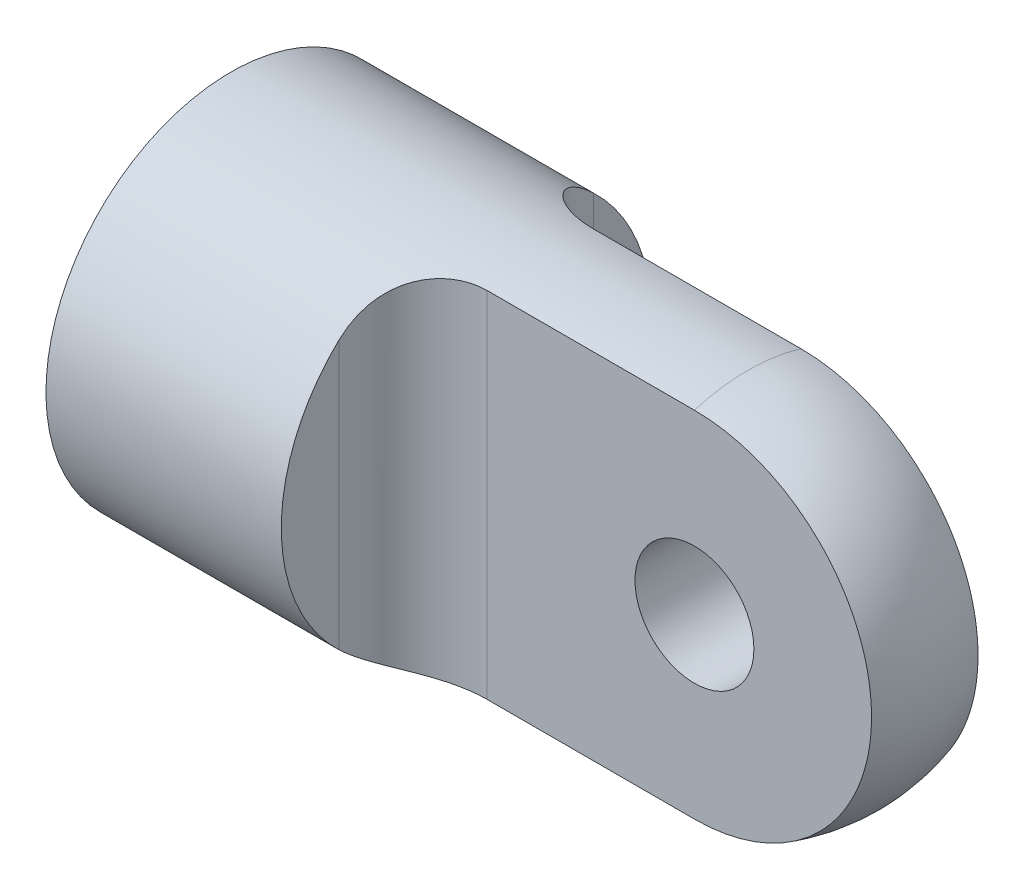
ISO-10303-21;
HEADER;
FILE_DESCRIPTION(('STEP AP214'),'2;1');
FILE_NAME('part.step','',(''),(''),'','','');
FILE_SCHEMA(('AUTOMOTIVE_DESIGN { 1 0 10303 214 1 1 1 1 }'));
ENDSEC;
DATA;
#1=APPLICATION_CONTEXT('core data for automotive mechanical design processes');
#2=APPLICATION_PROTOCOL_DEFINITION('international standard','automotive_design',2000,#1);
#3=PRODUCT_CONTEXT('',#1,'mechanical');
#4=PRODUCT('Part','Part','',(#3));
#5=PRODUCT_RELATED_PRODUCT_CATEGORY('part','',(#4));
#6=PRODUCT_DEFINITION_FORMATION('','',#4);
#7=PRODUCT_DEFINITION_CONTEXT('part definition',#1,'design');
#8=PRODUCT_DEFINITION('design','',#6,#7);
#9=PRODUCT_DEFINITION_SHAPE('','',#8);
#10=(LENGTH_UNIT() NAMED_UNIT(*) SI_UNIT(.MILLI.,.METRE.));
#11=(NAMED_UNIT(*) PLANE_ANGLE_UNIT() SI_UNIT($,.RADIAN.));
#12=(NAMED_UNIT(*) SI_UNIT($,.STERADIAN.) SOLID_ANGLE_UNIT());
#13=UNCERTAINTY_MEASURE_WITH_UNIT(LENGTH_MEASURE(1.E-05),#10,'distance_accuracy_value','');
#14=(GEOMETRIC_REPRESENTATION_CONTEXT(3) GLOBAL_UNCERTAINTY_ASSIGNED_CONTEXT((#13)) GLOBAL_UNIT_ASSIGNED_CONTEXT((#10,
#11,#12)) REPRESENTATION_CONTEXT('',''));
#15=CARTESIAN_POINT('',(0.,0.,0.));
#16=DIRECTION('',(0.,0.,1.));
#17=DIRECTION('',(1.,0.,0.));
#18=AXIS2_PLACEMENT_3D('',#15,#16,#17);
#19=CARTESIAN_POINT('',(-15.0622,0.,0.));
#20=DIRECTION('',(1.,0.,0.));
#21=DIRECTION('',(0.,1.,0.));
#22=AXIS2_PLACEMENT_3D('',#19,#20,#21);
#23=PLANE('',#22);
#24=CARTESIAN_POINT('',(-15.0622,0.,0.));
#25=DIRECTION('',(-1.,0.,0.));
#26=DIRECTION('',(0.,0.,1.));
#27=AXIS2_PLACEMENT_3D('',#24,#25,#26);
#28=CIRCLE('',#27,2.5527);
#29=CARTESIAN_POINT('',(-15.0622,0.,2.5527));
#30=VERTEX_POINT('',#29);
#31=EDGE_CURVE('E103',#30,#30,#28,.T.);
#32=ORIENTED_EDGE('',*,*,#31,.F.);
#33=EDGE_LOOP('',(#32));
#34=FACE_BOUND('',#33,.T.);
#35=CARTESIAN_POINT('',(-15.0622,0.,0.));
#36=DIRECTION('',(-1.,0.,0.));
#37=DIRECTION('',(0.,-1.,0.));
#38=AXIS2_PLACEMENT_3D('',#35,#36,#37);
#39=CIRCLE('',#38,7.9375);
#40=CARTESIAN_POINT('',(-15.0622,-7.9375,0.));
#41=VERTEX_POINT('',#40);
#42=EDGE_CURVE('E127',#41,#41,#39,.T.);
#43=ORIENTED_EDGE('',*,*,#42,.T.);
#44=EDGE_LOOP('',(#43));
#45=FACE_BOUND('',#44,.T.);
#46=ADVANCED_FACE('F38',(#34,#45),#23,.F.);
#47=CARTESIAN_POINT('',(7.1247,0.,0.));
#48=DIRECTION('',(-1.,0.,0.));
#49=DIRECTION('',(0.,-1.,0.));
#50=AXIS2_PLACEMENT_3D('',#47,#48,#49);
#51=SPHERICAL_SURFACE('',#50,7.9375);
#52=CARTESIAN_POINT('',(7.1247,0.,0.));
#53=DIRECTION('',(-1.,0.,0.));
#54=DIRECTION('',(0.,-1.,0.));
#55=AXIS2_PLACEMENT_3D('',#52,#53,#54);
#56=CIRCLE('',#55,7.9375);
#57=CARTESIAN_POINT('',(7.1247,-7.60119137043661,-2.286));
#58=VERTEX_POINT('',#57);
#59=CARTESIAN_POINT('',(7.12470000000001,-7.60119137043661,2.286));
#60=VERTEX_POINT('',#59);
#61=EDGE_CURVE('E130',#58,#60,#56,.T.);
#62=ORIENTED_EDGE('',*,*,#61,.F.);
#63=CARTESIAN_POINT('',(7.1247,0.,-2.286));
#64=DIRECTION('',(0.,0.,1.));
#65=DIRECTION('',(1.,0.,0.));
#66=AXIS2_PLACEMENT_3D('',#63,#64,#65);
#67=CIRCLE('',#66,7.60119137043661);
#68=CARTESIAN_POINT('',(7.1247,7.60119137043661,-2.286));
#69=VERTEX_POINT('',#68);
#70=EDGE_CURVE('E116',#58,#69,#67,.T.);
#71=ORIENTED_EDGE('',*,*,#70,.T.);
#72=CARTESIAN_POINT('',(7.1247,7.6011913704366,2.286));
#73=VERTEX_POINT('',#72);
#74=EDGE_CURVE('E131',#73,#69,#56,.T.);
#75=ORIENTED_EDGE('',*,*,#74,.F.);
#76=CARTESIAN_POINT('',(7.1247,0.,2.286));
#77=DIRECTION('',(0.,0.,-1.));
#78=DIRECTION('',(-1.,0.,0.));
#79=AXIS2_PLACEMENT_3D('',#76,#77,#78);
#80=CIRCLE('',#79,7.60119137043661);
#81=EDGE_CURVE('E59',#73,#60,#80,.T.);
#82=ORIENTED_EDGE('',*,*,#81,.T.);
#83=EDGE_LOOP('',(#62,#71,#75,#82));
#84=FACE_BOUND('',#83,.T.);
#85=ADVANCED_FACE('F168',(#84),#51,.T.);
#86=CARTESIAN_POINT('',(-15.0622,0.,0.));
#87=DIRECTION('',(-1.,0.,0.));
#88=DIRECTION('',(0.,-1.,0.));
#89=AXIS2_PLACEMENT_3D('',#86,#87,#88);
#90=CYLINDRICAL_SURFACE('',#89,7.9375);
#91=ORIENTED_EDGE('',*,*,#42,.F.);
#92=EDGE_LOOP('',(#91));
#93=FACE_BOUND('',#92,.T.);
#94=ORIENTED_EDGE('',*,*,#74,.T.);
#95=DIRECTION('',(-1.,0.,0.));
#96=VECTOR('',#95,1.);
#97=CARTESIAN_POINT('',(-15.0622,7.60119137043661,-2.286));
#98=LINE('',#97,#96);
#99=CARTESIAN_POINT('',(-1.78410862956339,7.60119137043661,-2.286));
#100=VERTEX_POINT('',#99);
#101=EDGE_CURVE('E11',#69,#100,#98,.T.);
#102=ORIENTED_EDGE('',*,*,#101,.T.);
#103=CARTESIAN_POINT('',(-1.78410862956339,-7.60119137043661,-2.286));
#104=CARTESIAN_POINT('',(-1.61365310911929,-7.60119066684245,-2.28600315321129));
#105=CARTESIAN_POINT('',(-1.44318540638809,-7.59709120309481,-2.29976913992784));
#106=CARTESIAN_POINT('',(-1.10707106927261,-7.58035076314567,-2.35435595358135));
#107=CARTESIAN_POINT('',(-0.941424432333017,-7.56770979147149,-2.39517676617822));
#108=CARTESIAN_POINT('',(-0.619618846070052,-7.53293356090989,-2.50239358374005));
#109=CARTESIAN_POINT('',(-0.463462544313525,-7.51079566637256,-2.56879668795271));
#110=CARTESIAN_POINT('',(-0.16517553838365,-7.45569235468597,-2.72458232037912));
#111=CARTESIAN_POINT('',(-0.023042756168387,-7.4227285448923,-2.81396143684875));
#112=CARTESIAN_POINT('',(0.242764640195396,-7.34476408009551,-3.01156747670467));
#113=CARTESIAN_POINT('',(0.366513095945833,-7.29981372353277,-3.11971499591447));
#114=CARTESIAN_POINT('',(0.593344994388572,-7.19683688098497,-3.3504276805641));
#115=CARTESIAN_POINT('',(0.696429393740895,-7.13881100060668,-3.47299217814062));
#116=CARTESIAN_POINT('',(0.881768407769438,-7.00841328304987,-3.7292070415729));
#117=CARTESIAN_POINT('',(0.96368822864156,-6.93583975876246,-3.86299585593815));
#118=CARTESIAN_POINT('',(1.10463365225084,-6.77742035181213,-4.13463642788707));
#119=CARTESIAN_POINT('',(1.16365312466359,-6.6915709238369,-4.27248926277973));
#120=CARTESIAN_POINT('',(1.26439881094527,-6.49966660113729,-4.55967280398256));
#121=CARTESIAN_POINT('',(1.30414468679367,-6.39249817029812,-4.70894534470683));
#122=CARTESIAN_POINT('',(1.3611257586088,-6.16572531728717,-5.0022156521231));
#123=CARTESIAN_POINT('',(1.37834653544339,-6.04611298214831,-5.14620998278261));
#124=CARTESIAN_POINT('',(1.39217210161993,-5.82258792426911,-5.39661073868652));
#125=CARTESIAN_POINT('',(1.39232918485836,-5.72060798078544,-5.50459032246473));
#126=CARTESIAN_POINT('',(1.38250216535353,-5.51098615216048,-5.71445233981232));
#127=CARTESIAN_POINT('',(1.3725132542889,-5.40334160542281,-5.81633185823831));
#128=CARTESIAN_POINT('',(1.32978369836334,-5.07268135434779,-6.11222109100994));
#129=CARTESIAN_POINT('',(1.28427296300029,-4.84220409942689,-6.29618548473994));
#130=CARTESIAN_POINT('',(1.18590077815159,-4.42808696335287,-6.59112990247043));
#131=CARTESIAN_POINT('',(1.13798896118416,-4.24776017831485,-6.7086774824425));
#132=CARTESIAN_POINT('',(1.03426595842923,-3.87976253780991,-6.92800097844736));
#133=CARTESIAN_POINT('',(0.978450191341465,-3.69208746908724,-7.02976767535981));
#134=CARTESIAN_POINT('',(0.862930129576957,-3.30971298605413,-7.21770283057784));
#135=CARTESIAN_POINT('',(0.803217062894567,-3.11499819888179,-7.30383432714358));
#136=CARTESIAN_POINT('',(0.684351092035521,-2.71918890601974,-7.46023983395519));
#137=CARTESIAN_POINT('',(0.625198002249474,-2.51809661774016,-7.53051928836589));
#138=CARTESIAN_POINT('',(0.526209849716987,-2.15954765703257,-7.63978103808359));
#139=CARTESIAN_POINT('',(0.485191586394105,-2.00346543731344,-7.68221292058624));
#140=CARTESIAN_POINT('',(0.408754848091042,-1.68767472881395,-7.75770642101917));
#141=CARTESIAN_POINT('',(0.373335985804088,-1.52796649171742,-7.79076868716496));
#142=CARTESIAN_POINT('',(0.310968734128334,-1.20617746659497,-7.84700874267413));
#143=CARTESIAN_POINT('',(0.283970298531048,-1.04411692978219,-7.87024523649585));
#144=CARTESIAN_POINT('',(0.24071382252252,-0.717441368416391,-7.90671699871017));
#145=CARTESIAN_POINT('',(0.224453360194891,-0.552826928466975,-7.91995452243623));
#146=CARTESIAN_POINT('',(0.204406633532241,-0.220487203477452,-7.93619927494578));
#147=CARTESIAN_POINT('',(0.20075911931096,-0.0527476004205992,-7.939092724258));
#148=CARTESIAN_POINT('',(0.206792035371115,0.282333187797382,-7.93424704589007));
#149=CARTESIAN_POINT('',(0.216473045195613,0.449674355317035,-7.92650745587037));
#150=CARTESIAN_POINT('',(0.248041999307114,0.783183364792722,-7.90054810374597));
#151=CARTESIAN_POINT('',(0.269990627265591,0.949341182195,-7.8822762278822));
#152=CARTESIAN_POINT('',(0.323760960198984,1.27859695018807,-7.83560902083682));
#153=CARTESIAN_POINT('',(0.355585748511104,1.44169392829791,-7.80721052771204));
#154=CARTESIAN_POINT('',(0.43867835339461,1.82068327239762,-7.72906456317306));
#155=CARTESIAN_POINT('',(0.492854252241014,2.03510856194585,-7.67532458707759));
#156=CARTESIAN_POINT('',(0.607655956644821,2.45719279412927,-7.55079946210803));
#157=CARTESIAN_POINT('',(0.668284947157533,2.66484832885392,-7.4800058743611));
#158=CARTESIAN_POINT('',(0.790509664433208,3.07334878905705,-7.32163994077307));
#159=CARTESIAN_POINT('',(0.852105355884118,3.27419396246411,-7.23406820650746));
#160=CARTESIAN_POINT('',(0.971495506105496,3.66879847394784,-7.04215261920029));
#161=CARTESIAN_POINT('',(1.02929200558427,3.86256159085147,-6.93781787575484));
#162=CARTESIAN_POINT('',(1.12072307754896,4.18621019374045,-6.74564558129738));
#163=CARTESIAN_POINT('',(1.15644763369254,4.31803657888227,-6.66205746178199));
#164=CARTESIAN_POINT('',(1.22217558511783,4.5775175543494,-6.48650678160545));
#165=CARTESIAN_POINT('',(1.25217883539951,4.70517203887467,-6.3945440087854));
#166=CARTESIAN_POINT('',(1.30468326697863,4.95552807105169,-6.20253892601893));
#167=CARTESIAN_POINT('',(1.3271975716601,5.07823794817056,-6.10251113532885));
#168=CARTESIAN_POINT('',(1.36291788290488,5.31820276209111,-5.89455707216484));
#169=CARTESIAN_POINT('',(1.37612706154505,5.4354595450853,-5.78663350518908));
#170=CARTESIAN_POINT('',(1.38916802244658,5.63279981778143,-5.59366124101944));
#171=CARTESIAN_POINT('',(1.39164927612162,5.71436988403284,-5.51030692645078));
#172=CARTESIAN_POINT('',(1.38973019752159,5.87371246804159,-5.34012958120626));
#173=CARTESIAN_POINT('',(1.38533163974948,5.9514859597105,-5.25330745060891));
#174=CARTESIAN_POINT('',(1.36880686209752,6.10273200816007,-5.07681617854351));
#175=CARTESIAN_POINT('',(1.35668745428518,6.17620829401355,-4.98714961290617));
#176=CARTESIAN_POINT('',(1.32388973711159,6.3184497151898,-4.80566133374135));
#177=CARTESIAN_POINT('',(1.30321301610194,6.38721572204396,-4.71384002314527));
#178=CARTESIAN_POINT('',(1.25707654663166,6.50771802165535,-4.54557240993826));
#179=CARTESIAN_POINT('',(1.23313426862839,6.56030004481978,-4.46931431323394));
#180=CARTESIAN_POINT('',(1.17861560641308,6.6617201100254,-4.31668637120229));
#181=CARTESIAN_POINT('',(1.14804053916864,6.71055889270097,-4.24031655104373));
#182=CARTESIAN_POINT('',(1.07998402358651,6.80429197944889,-4.08821458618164));
#183=CARTESIAN_POINT('',(1.04250194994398,6.84918592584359,-4.01248249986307));
#184=CARTESIAN_POINT('',(0.960502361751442,6.93484231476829,-3.86255340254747));
#185=CARTESIAN_POINT('',(0.915988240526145,6.97560673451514,-3.78835567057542));
#186=CARTESIAN_POINT('',(0.819612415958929,7.0531625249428,-3.64193761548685));
#187=CARTESIAN_POINT('',(0.767708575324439,7.08992881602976,-3.56973168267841));
#188=CARTESIAN_POINT('',(0.65691858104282,7.15917271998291,-3.42874889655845));
#189=CARTESIAN_POINT('',(0.598035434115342,7.19165216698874,-3.35997058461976));
#190=CARTESIAN_POINT('',(0.473556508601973,7.25240445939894,-3.22674735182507));
#191=CARTESIAN_POINT('',(0.407959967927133,7.28067682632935,-3.16230292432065));
#192=CARTESIAN_POINT('',(0.270499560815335,7.33314345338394,-3.03865521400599));
#193=CARTESIAN_POINT('',(0.198636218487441,7.35733805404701,-2.97945149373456));
#194=CARTESIAN_POINT('',(0.0563169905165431,7.39972672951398,-2.87244533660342));
#195=CARTESIAN_POINT('',(-0.0136226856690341,7.4182726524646,-2.82409407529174));
#196=CARTESIAN_POINT('',(-0.157711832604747,7.45236469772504,-2.73286280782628));
#197=CARTESIAN_POINT('',(-0.231862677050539,7.46790983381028,-2.68998460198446));
#198=CARTESIAN_POINT('',(-0.383782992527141,7.49616982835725,-2.61019887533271));
#199=CARTESIAN_POINT('',(-0.461550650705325,7.50888608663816,-2.57328840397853));
#200=CARTESIAN_POINT('',(-0.62016311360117,7.53168060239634,-2.50578421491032));
#201=CARTESIAN_POINT('',(-0.701009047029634,7.54175788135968,-2.47519284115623));
#202=CARTESIAN_POINT('',(-0.943372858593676,7.56786270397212,-2.39469473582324));
#203=CARTESIAN_POINT('',(-1.10848331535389,7.58043336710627,-2.35409091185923));
#204=CARTESIAN_POINT('',(-1.44339178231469,7.5970891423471,-2.29977151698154));
#205=CARTESIAN_POINT('',(-1.61318979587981,7.60117424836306,-2.28605596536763));
#206=CARTESIAN_POINT('',(-1.95368284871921,7.60120846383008,-2.28594413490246));
#207=CARTESIAN_POINT('',(-2.12437807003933,7.59711620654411,-2.29968675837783));
#208=CARTESIAN_POINT('',(-2.46093966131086,7.58036858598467,-2.35429867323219));
#209=CARTESIAN_POINT('',(-2.62680600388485,7.56771317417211,-2.3951681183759));
#210=CARTESIAN_POINT('',(-2.94903080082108,7.53288202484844,-2.50255069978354));
#211=CARTESIAN_POINT('',(-3.10538619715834,7.51070324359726,-2.56907203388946));
#212=CARTESIAN_POINT('',(-3.40402504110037,7.45548637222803,-2.72515060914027));
#213=CARTESIAN_POINT('',(-3.54631064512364,7.42244994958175,-2.81470431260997));
#214=CARTESIAN_POINT('',(-3.81218545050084,7.34435625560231,-3.01256437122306));
#215=CARTESIAN_POINT('',(-3.93587257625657,7.29936566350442,-3.12076557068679));
#216=CARTESIAN_POINT('',(-4.16257442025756,7.19630626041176,-3.35156943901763));
#217=CARTESIAN_POINT('',(-4.26559015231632,7.13823809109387,-3.47417140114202));
#218=CARTESIAN_POINT('',(-4.45079441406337,7.00775115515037,-3.73045328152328));
#219=CARTESIAN_POINT('',(-4.53264659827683,6.93512979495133,-3.86427201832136));
#220=CARTESIAN_POINT('',(-4.67345614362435,6.77661572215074,-4.13595672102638));
#221=CARTESIAN_POINT('',(-4.73240734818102,6.69071944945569,-4.27382376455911));
#222=CARTESIAN_POINT('',(-4.83302150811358,6.4987060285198,-4.56104412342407));
#223=CARTESIAN_POINT('',(-4.87270079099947,6.39147356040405,-4.71033790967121));
#224=CARTESIAN_POINT('',(-4.92954998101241,6.16457396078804,-5.00363633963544));
#225=CARTESIAN_POINT('',(-4.94670547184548,6.04489891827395,-5.14763753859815));
#226=CARTESIAN_POINT('',(-4.96041960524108,5.8212364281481,-5.39807056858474));
#227=CARTESIAN_POINT('',(-4.96052648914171,5.71917960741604,-5.5060762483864));
#228=CARTESIAN_POINT('',(-4.95059748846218,5.50940247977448,-5.71598102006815));
#229=CARTESIAN_POINT('',(-4.94055679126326,5.40167950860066,-5.81787719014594));
#230=CARTESIAN_POINT('',(-4.89767205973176,5.07078141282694,-6.11380396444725));
#231=CARTESIAN_POINT('',(-4.85205823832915,4.84014301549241,-6.29777603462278));
#232=CARTESIAN_POINT('',(-4.75351962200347,4.42574920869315,-6.59270269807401));
#233=CARTESIAN_POINT('',(-4.70554201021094,4.24530806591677,-6.71023223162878));
#234=CARTESIAN_POINT('',(-4.60169956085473,3.87707900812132,-6.92950578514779));
#235=CARTESIAN_POINT('',(-4.54583014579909,3.68928687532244,-7.03124057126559));
#236=CARTESIAN_POINT('',(-4.43022094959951,3.30667587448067,-7.21909734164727));
#237=CARTESIAN_POINT('',(-4.37047247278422,3.11184168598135,-7.30518248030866));
#238=CARTESIAN_POINT('',(-4.25156138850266,2.7157884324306,-7.46148106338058));
#239=CARTESIAN_POINT('',(-4.19239858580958,2.51457159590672,-7.53169997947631));
#240=CARTESIAN_POINT('',(-4.09347443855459,2.15597607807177,-7.64078743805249));
#241=CARTESIAN_POINT('',(-4.05251837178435,1.99997720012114,-7.6831195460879));
#242=CARTESIAN_POINT('',(-3.97621676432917,1.68435937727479,-7.75842470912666));
#243=CARTESIAN_POINT('',(-3.94087083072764,1.52474068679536,-7.79139841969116));
#244=CARTESIAN_POINT('',(-3.87865463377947,1.20313734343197,-7.84747326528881));
#245=CARTESIAN_POINT('',(-3.85173432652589,1.04117287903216,-7.8706329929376));
#246=CARTESIAN_POINT('',(-3.80863229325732,0.714698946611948,-7.90696312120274));
#247=CARTESIAN_POINT('',(-3.79244815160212,0.550190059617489,-7.92013576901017));
#248=CARTESIAN_POINT('',(-3.77254373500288,0.218081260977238,-7.93626316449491));
#249=CARTESIAN_POINT('',(-3.76896140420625,0.0504672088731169,-7.93910483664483));
#250=CARTESIAN_POINT('',(-3.77510250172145,-0.284355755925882,-7.93417211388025));
#251=CARTESIAN_POINT('',(-3.78482652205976,-0.451564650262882,-7.92639724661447));
#252=CARTESIAN_POINT('',(-3.81645645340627,-0.784807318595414,-7.900384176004));
#253=CARTESIAN_POINT('',(-3.8384229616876,-0.950831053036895,-7.88209390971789));
#254=CARTESIAN_POINT('',(-3.89220667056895,-1.27982108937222,-7.83540640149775));
#255=CARTESIAN_POINT('',(-3.92402693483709,-1.44278642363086,-7.80700601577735));
#256=CARTESIAN_POINT('',(-4.00713327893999,-1.82167040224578,-7.72883282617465));
#257=CARTESIAN_POINT('',(-4.06133250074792,-2.03611809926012,-7.67505772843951));
#258=CARTESIAN_POINT('',(-4.17617316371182,-2.45824529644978,-7.55045778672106));
#259=CARTESIAN_POINT('',(-4.23681779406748,-2.66592137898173,-7.47962448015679));
#260=CARTESIAN_POINT('',(-4.3590647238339,-3.07445949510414,-7.3211745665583));
#261=CARTESIAN_POINT('',(-4.42066698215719,-3.27532181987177,-7.23355867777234));
#262=CARTESIAN_POINT('',(-4.54006031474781,-3.66995766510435,-7.04154965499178));
#263=CARTESIAN_POINT('',(-4.59785343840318,-3.86373497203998,-6.93716564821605));
#264=CARTESIAN_POINT('',(-4.68925058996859,-4.18734034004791,-6.74494299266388));
#265=CARTESIAN_POINT('',(-4.72494956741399,-4.31911219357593,-6.66135903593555));
#266=CARTESIAN_POINT('',(-4.79062574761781,-4.57848562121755,-6.48582233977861));
#267=CARTESIAN_POINT('',(-4.82060280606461,-4.70608709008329,-6.3938693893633));
#268=CARTESIAN_POINT('',(-4.87305573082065,-4.95633912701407,-6.20188960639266));
#269=CARTESIAN_POINT('',(-4.8955447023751,-5.07899801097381,-6.10187726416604));
#270=CARTESIAN_POINT('',(-4.93121657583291,-5.3188628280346,-5.89396013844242));
#271=CARTESIAN_POINT('',(-4.94440264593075,-5.43607060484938,-5.78605805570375));
#272=CARTESIAN_POINT('',(-4.95740830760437,-5.63334762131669,-5.59310933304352));
#273=CARTESIAN_POINT('',(-4.95987504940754,-5.71490205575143,-5.50975475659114));
#274=CARTESIAN_POINT('',(-4.957926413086,-5.87421316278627,-5.33957856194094));
#275=CARTESIAN_POINT('',(-4.95351280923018,-5.95197080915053,-5.25275784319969));
#276=CARTESIAN_POINT('',(-4.93695765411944,-6.10318500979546,-5.07627130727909));
#277=CARTESIAN_POINT('',(-4.92482291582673,-6.17664529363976,-4.98660806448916));
#278=CARTESIAN_POINT('',(-4.89199456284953,-6.31885465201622,-4.80512855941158));
#279=CARTESIAN_POINT('',(-4.87130253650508,-6.38760459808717,-4.71331269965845));
#280=CARTESIAN_POINT('',(-4.82513829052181,-6.50807855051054,-4.54505599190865));
#281=CARTESIAN_POINT('',(-4.80118337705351,-6.56064821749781,-4.46880296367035));
#282=CARTESIAN_POINT('',(-4.74663981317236,-6.66204366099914,-4.31618676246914));
#283=CARTESIAN_POINT('',(-4.71605247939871,-6.71087017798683,-4.23982361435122));
#284=CARTESIAN_POINT('',(-4.64797208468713,-6.80457896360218,-4.08773662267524));
#285=CARTESIAN_POINT('',(-4.61047839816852,-6.84946087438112,-4.01201283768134));
#286=CARTESIAN_POINT('',(-4.52845654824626,-6.93509359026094,-3.86210191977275));
#287=CARTESIAN_POINT('',(-4.48393177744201,-6.97584637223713,-3.78791406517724));
#288=CARTESIAN_POINT('',(-4.38753599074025,-7.05337926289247,-3.64151749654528));
#289=CARTESIAN_POINT('',(-4.33562286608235,-7.09013430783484,-3.56932317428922));
#290=CARTESIAN_POINT('',(-4.22481587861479,-7.15935647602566,-3.42836482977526));
#291=CARTESIAN_POINT('',(-4.16592502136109,-7.19182543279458,-3.3595993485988));
#292=CARTESIAN_POINT('',(-4.04143246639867,-7.25255761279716,-3.22640273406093));
#293=CARTESIAN_POINT('',(-3.97583000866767,-7.28082035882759,-3.16197209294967));
#294=CARTESIAN_POINT('',(-3.83835966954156,-7.33326871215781,-3.03835254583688));
#295=CARTESIAN_POINT('',(-3.76649231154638,-7.35745465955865,-2.97916320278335));
#296=CARTESIAN_POINT('',(-3.6241636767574,-7.39982888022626,-2.87218194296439));
#297=CARTESIAN_POINT('',(-3.55421818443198,-7.41836874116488,-2.82384144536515));
#298=CARTESIAN_POINT('',(-3.41011857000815,-7.45244915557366,-2.73263226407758));
#299=CARTESIAN_POINT('',(-3.33596307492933,-7.46798872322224,-2.68976538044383));
#300=CARTESIAN_POINT('',(-3.18403442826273,-7.49623811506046,-2.61000255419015));
#301=CARTESIAN_POINT('',(-3.10626307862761,-7.50894933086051,-2.57310367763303));
#302=CARTESIAN_POINT('',(-2.9476443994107,-7.53173420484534,-2.50562291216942));
#303=CARTESIAN_POINT('',(-2.86679594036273,-7.54180688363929,-2.47504336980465));
#304=CARTESIAN_POINT('',(-2.62431751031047,-7.56791043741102,-2.39454422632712));
#305=CARTESIAN_POINT('',(-2.45908985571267,-7.5804786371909,-2.35394480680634));
#306=CARTESIAN_POINT('',(-2.12394837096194,-7.59711944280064,-2.29967115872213));
#307=CARTESIAN_POINT('',(-1.95403455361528,-7.60119207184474,-2.28599685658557));
#308=CARTESIAN_POINT('',(-1.78410862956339,-7.60119137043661,-2.286));
#309=B_SPLINE_CURVE_WITH_KNOTS('',3,(#103,#104,#105,#106,#107,#108,#109,#110,#111,#112,#113,
#114,#115,#116,#117,#118,#119,#120,#121,#122,#123,#124,#125,#126,#127,#128,#129,#130,#131,#132,
#133,#134,#135,#136,#137,#138,#139,#140,#141,#142,#143,#144,#145,#146,#147,#148,#149,#150,#151,
#152,#153,#154,#155,#156,#157,#158,#159,#160,#161,#162,#163,#164,#165,#166,#167,#168,#169,#170,
#171,#172,#173,#174,#175,#176,#177,#178,#179,#180,#181,#182,#183,#184,#185,#186,#187,#188,#189,
#190,#191,#192,#193,#194,#195,#196,#197,#198,#199,#200,#201,#202,#203,#204,#205,#206,#207,#208,
#209,#210,#211,#212,#213,#214,#215,#216,#217,#218,#219,#220,#221,#222,#223,#224,#225,#226,#227,
#228,#229,#230,#231,#232,#233,#234,#235,#236,#237,#238,#239,#240,#241,#242,#243,#244,#245,#246,
#247,#248,#249,#250,#251,#252,#253,#254,#255,#256,#257,#258,#259,#260,#261,#262,#263,#264,#265,
#266,#267,#268,#269,#270,#271,#272,#273,#274,#275,#276,#277,#278,#279,#280,#281,#282,#283,#284,
#285,#286,#287,#288,#289,#290,#291,#292,#293,#294,#295,#296,#297,#298,#299,#300,#301,#302,#303,
#304,#305,#306,#307,#308),.UNSPECIFIED.,.T.,.F.,(4,2,2,2,2,2,2,2,2,2,2,2,2,2,2,2,2,2,2,2,2,2,2,
2,2,2,2,2,2,2,2,2,2,2,2,2,2,2,2,2,2,2,2,2,2,2,2,2,2,2,2,2,2,2,2,2,2,2,2,2,2,2,2,2,2,2,2,2,2,2,2,
2,2,2,2,2,2,2,2,2,2,2,2,2,2,2,2,2,2,2,2,2,2,2,2,2,2,2,2,2,2,2,4),(0.,0.510786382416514,
1.02157249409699,1.53250045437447,2.04335258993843,2.5520939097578,3.06081167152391,
3.57714218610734,4.09361082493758,4.655556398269,5.21786151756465,5.66282192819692,
6.10799330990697,6.99951365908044,7.66033522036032,8.32154138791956,8.98429085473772,
9.64681236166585,10.1470811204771,10.6473152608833,11.1445169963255,11.6416065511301,
12.1441472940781,12.6467098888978,13.1517807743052,13.6570095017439,14.3387886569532,
15.0209058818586,15.7029982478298,16.3847211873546,16.8647866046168,17.3448641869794,
17.8240960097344,18.3031643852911,18.6528441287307,19.0024336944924,19.3517152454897,
19.7009319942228,19.9876731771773,20.2743574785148,20.5610677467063,20.8476400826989,
21.1359173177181,21.4240708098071,21.7122570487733,22.0004192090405,22.2611741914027,
22.5220147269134,22.7827259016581,23.0435336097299,23.5524026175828,24.0612719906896,
24.5727220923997,25.0841750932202,25.5957916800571,26.107329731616,26.6160722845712,
27.1247898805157,27.6411543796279,28.1576575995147,28.7197211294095,29.282144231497,
29.7273194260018,30.172705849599,31.0646597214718,31.7257757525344,32.387276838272,
33.0503157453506,33.7131256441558,34.2130388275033,34.7129169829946,35.2097671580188,
35.7065055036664,36.208664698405,36.7108462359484,37.2155358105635,37.7203824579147,
38.4022663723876,39.0844892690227,39.7666829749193,40.4485065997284,40.9284138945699,
41.4083332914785,41.8874082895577,42.3663200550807,42.7159666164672,43.0655230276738,
43.4147714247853,43.7639550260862,44.0506732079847,44.3373345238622,44.6240218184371,
44.9105712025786,45.1988245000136,45.4869540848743,45.775116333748,46.0632545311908,
46.3240017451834,46.5848344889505,46.8455386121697,47.1063393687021,47.6155401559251,
48.1247395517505),.UNSPECIFIED.);
#310=CARTESIAN_POINT('',(-4.95910862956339,5.76032857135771,-5.461));
#311=VERTEX_POINT('',#310);
#312=EDGE_CURVE('E45',#100,#311,#309,.T.);
#313=ORIENTED_EDGE('',*,*,#312,.T.);
#314=CARTESIAN_POINT('',(-4.95910862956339,0.,0.));
#315=DIRECTION('',(-1.,0.,0.));
#316=DIRECTION('',(0.,0.,1.));
#317=AXIS2_PLACEMENT_3D('',#314,#315,#316);
#318=CIRCLE('',#317,7.9375);
#319=CARTESIAN_POINT('',(-4.95910862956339,-5.76032857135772,-5.461));
#320=VERTEX_POINT('',#319);
#321=EDGE_CURVE('E192',#311,#320,#318,.T.);
#322=ORIENTED_EDGE('',*,*,#321,.T.);
#323=CARTESIAN_POINT('',(-1.78410862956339,-7.60119137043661,-2.286));
#324=VERTEX_POINT('',#323);
#325=EDGE_CURVE('E190',#320,#324,#309,.T.);
#326=ORIENTED_EDGE('',*,*,#325,.T.);
#327=DIRECTION('',(-1.,0.,0.));
#328=VECTOR('',#327,1.);
#329=CARTESIAN_POINT('',(-15.0622,-7.60119137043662,-2.286));
#330=LINE('',#329,#328);
#331=EDGE_CURVE('E185',#324,#58,#330,.F.);
#332=ORIENTED_EDGE('',*,*,#331,.T.);
#333=ORIENTED_EDGE('',*,*,#61,.T.);
#334=DIRECTION('',(-1.,0.,0.));
#335=VECTOR('',#334,1.);
#336=CARTESIAN_POINT('',(-15.0622,-7.60119137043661,2.286));
#337=LINE('',#336,#335);
#338=CARTESIAN_POINT('',(-1.78410862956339,-7.6011913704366,2.286));
#339=VERTEX_POINT('',#338);
#340=EDGE_CURVE('E286',#60,#339,#337,.T.);
#341=ORIENTED_EDGE('',*,*,#340,.T.);
#342=CARTESIAN_POINT('',(0.202741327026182,0.,7.9375));
#343=CARTESIAN_POINT('',(0.20272847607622,-0.13406312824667,7.93750297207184));
#344=CARTESIAN_POINT('',(0.206999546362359,-0.268099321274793,7.93409970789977));
#345=CARTESIAN_POINT('',(0.223707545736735,-0.535318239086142,7.92055718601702));
#346=CARTESIAN_POINT('',(0.236144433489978,-0.668500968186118,7.91041796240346));
#347=CARTESIAN_POINT('',(0.26833393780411,-0.933862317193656,7.88350673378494));
#348=CARTESIAN_POINT('',(0.28811754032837,-1.06603422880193,7.8667066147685));
#349=CARTESIAN_POINT('',(0.333690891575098,-1.32834718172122,7.82668571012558));
#350=CARTESIAN_POINT('',(0.359481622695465,-1.458487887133,7.80346387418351));
#351=CARTESIAN_POINT('',(0.434941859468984,-1.80514214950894,7.73270483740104));
#352=CARTESIAN_POINT('',(0.488843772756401,-2.01957239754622,7.67942289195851));
#353=CARTESIAN_POINT('',(0.603246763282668,-2.44171840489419,7.55581617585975));
#354=CARTESIAN_POINT('',(0.663752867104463,-2.64942889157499,7.48547837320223));
#355=CARTESIAN_POINT('',(0.785888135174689,-3.05815415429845,7.32799929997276));
#356=CARTESIAN_POINT('',(0.847517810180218,-3.25916576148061,7.24085020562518));
#357=CARTESIAN_POINT('',(0.967086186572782,-3.65409930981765,7.04978977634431));
#358=CARTESIAN_POINT('',(1.02502709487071,-3.84802545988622,6.94588859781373));
#359=CARTESIAN_POINT('',(1.11696292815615,-4.17253778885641,6.75412516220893));
#360=CARTESIAN_POINT('',(1.15300148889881,-4.30504241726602,6.67047599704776));
#361=CARTESIAN_POINT('',(1.21936391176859,-4.56586224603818,6.4947310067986));
#362=CARTESIAN_POINT('',(1.2496875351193,-4.69417727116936,6.40263482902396));
#363=CARTESIAN_POINT('',(1.30281624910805,-4.94581238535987,6.21030394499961));
#364=CARTESIAN_POINT('',(1.32563561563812,-5.0691415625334,6.11008514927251));
#365=CARTESIAN_POINT('',(1.36193810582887,-5.31031992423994,5.90167593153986));
#366=CARTESIAN_POINT('',(1.37542448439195,-5.42817100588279,5.7934883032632));
#367=CARTESIAN_POINT('',(1.3888864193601,-5.62627028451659,5.60023125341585));
#368=CARTESIAN_POINT('',(1.39154033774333,-5.70802223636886,5.51688475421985));
#369=CARTESIAN_POINT('',(1.3899737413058,-5.86773155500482,5.34670347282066));
#370=CARTESIAN_POINT('',(1.38575500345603,-5.94568989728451,5.2598695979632));
#371=CARTESIAN_POINT('',(1.3695938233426,-6.09731154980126,5.08332822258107));
#372=CARTESIAN_POINT('',(1.35765782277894,-6.17097838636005,4.99362317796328));
#373=CARTESIAN_POINT('',(1.32522686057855,-6.31360172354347,4.81203256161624));
#374=CARTESIAN_POINT('',(1.30473348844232,-6.38255909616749,4.72014739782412));
#375=CARTESIAN_POINT('',(1.2589294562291,-6.50340061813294,4.55174986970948));
#376=CARTESIAN_POINT('',(1.23513802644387,-6.55613121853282,4.47543031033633));
#377=CARTESIAN_POINT('',(1.18091649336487,-6.65784726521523,4.32266025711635));
#378=CARTESIAN_POINT('',(1.1504877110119,-6.7068334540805,4.24620979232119));
#379=CARTESIAN_POINT('',(1.08271637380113,-6.80085768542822,4.09392840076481));
#380=CARTESIAN_POINT('',(1.04537331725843,-6.84589544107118,4.01809751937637));
#381=CARTESIAN_POINT('',(0.96364031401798,-6.93183473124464,3.86795195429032));
#382=CARTESIAN_POINT('',(0.919253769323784,-6.97273824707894,3.79363655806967));
#383=CARTESIAN_POINT('',(0.823116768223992,-7.05056812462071,3.64696178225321));
#384=CARTESIAN_POINT('',(0.771323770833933,-7.08746918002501,3.57461679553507));
#385=CARTESIAN_POINT('',(0.660736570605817,-7.15697353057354,3.43334131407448));
#386=CARTESIAN_POINT('',(0.601945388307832,-7.18957866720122,3.36440936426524));
#387=CARTESIAN_POINT('',(0.477628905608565,-7.25057191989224,3.23086743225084));
#388=CARTESIAN_POINT('',(0.412102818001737,-7.27895954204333,3.166257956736));
#389=CARTESIAN_POINT('',(0.274760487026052,-7.33164506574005,3.04227310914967));
#390=CARTESIAN_POINT('',(0.2029447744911,-7.35594331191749,2.9828972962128));
#391=CARTESIAN_POINT('',(0.0607385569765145,-7.39850464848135,2.87559427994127));
#392=CARTESIAN_POINT('',(-0.00913054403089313,-7.4171227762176,2.82711523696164));
#393=CARTESIAN_POINT('',(-0.153092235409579,-7.45135340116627,2.73562160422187));
#394=CARTESIAN_POINT('',(-0.227186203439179,-7.46696491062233,2.69260881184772));
#395=CARTESIAN_POINT('',(-0.379006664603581,-7.4953517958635,2.61254941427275));
#396=CARTESIAN_POINT('',(-0.456731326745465,-7.50812858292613,2.57549984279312));
#397=CARTESIAN_POINT('',(-0.615271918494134,-7.53103877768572,2.50771470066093));
#398=CARTESIAN_POINT('',(-0.696088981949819,-7.54117120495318,2.47698147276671));
#399=CARTESIAN_POINT('',(-0.938333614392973,-7.56742580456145,2.39608145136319));
#400=CARTESIAN_POINT('',(-1.10337006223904,-7.58008759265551,2.35520750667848));
#401=CARTESIAN_POINT('',(-1.43817923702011,-7.59691875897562,2.30033792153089));
#402=CARTESIAN_POINT('',(-1.60795196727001,-7.60108813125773,2.28634229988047));
#403=CARTESIAN_POINT('',(-1.94843978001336,-7.60129131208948,2.28566866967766));
#404=CARTESIAN_POINT('',(-2.11915529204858,-7.59728393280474,2.29912896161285));
#405=CARTESIAN_POINT('',(-2.45580705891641,-7.58071332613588,2.35318489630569));
#406=CARTESIAN_POINT('',(-2.62174328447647,-7.56815004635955,2.39378070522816));
#407=CARTESIAN_POINT('',(-2.94416342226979,-7.53351512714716,2.50063794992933));
#408=CARTESIAN_POINT('',(-3.10064386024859,-7.51144001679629,2.56690875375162));
#409=CARTESIAN_POINT('',(-3.39957599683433,-7.45644461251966,2.72251982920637));
#410=CARTESIAN_POINT('',(-3.54202983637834,-7.42352597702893,2.81185657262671));
#411=CARTESIAN_POINT('',(-3.80827420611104,-7.34567978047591,3.00932776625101));
#412=CARTESIAN_POINT('',(-3.93216260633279,-7.30081892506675,3.11735666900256));
#413=CARTESIAN_POINT('',(-4.15928965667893,-7.19802562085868,3.3478681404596));
#414=CARTESIAN_POINT('',(-4.2625293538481,-7.14009383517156,3.47034997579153));
#415=CARTESIAN_POINT('',(-4.44817131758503,-7.00989524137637,3.72641579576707));
#416=CARTESIAN_POINT('',(-4.53024254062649,-6.93742894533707,3.86013727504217));
#417=CARTESIAN_POINT('',(-4.67149241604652,-6.77922160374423,4.13167870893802));
#418=CARTESIAN_POINT('',(-4.73066494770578,-6.69347701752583,4.26949974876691));
#419=CARTESIAN_POINT('',(-4.83170541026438,-6.50181685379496,4.55660086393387));
#420=CARTESIAN_POINT('',(-4.87160048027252,-6.3947917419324,4.70582581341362));
#421=CARTESIAN_POINT('',(-4.92887700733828,-6.16830258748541,4.9990330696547));
#422=CARTESIAN_POINT('',(-4.94624404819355,-6.04883063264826,5.14301196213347));
#423=CARTESIAN_POINT('',(-4.96031917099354,-5.82561318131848,5.39334032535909));
#424=CARTESIAN_POINT('',(-4.96058862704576,-5.72380528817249,5.50126139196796));
#425=CARTESIAN_POINT('',(-4.95098991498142,-5.51453101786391,5.71102749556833));
#426=CARTESIAN_POINT('',(-4.94111694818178,-5.4070619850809,5.8128696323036));
#427=CARTESIAN_POINT('',(-4.89873484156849,-5.07693400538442,6.10867451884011));
#428=CARTESIAN_POINT('',(-4.85345495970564,-4.84681735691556,6.29262151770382));
#429=CARTESIAN_POINT('',(-4.75545576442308,-4.43331998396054,6.58760484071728));
#430=CARTESIAN_POINT('',(-4.70769158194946,-4.25324977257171,6.70519225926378));
#431=CARTESIAN_POINT('',(-4.60423679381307,-3.88577134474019,6.92462652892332));
#432=CARTESIAN_POINT('',(-4.54854159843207,-3.69835892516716,7.02646419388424));
#433=CARTESIAN_POINT('',(-4.43322217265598,-3.31651512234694,7.21457395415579));
#434=CARTESIAN_POINT('',(-4.37358899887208,-3.12206824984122,7.30080883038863));
#435=CARTESIAN_POINT('',(-4.25482544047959,-2.7268063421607,7.45745295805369));
#436=CARTESIAN_POINT('',(-4.19569489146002,-2.52599349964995,7.52786759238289));
#437=CARTESIAN_POINT('',(-4.09656406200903,-2.1675473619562,7.63752039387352));
#438=CARTESIAN_POINT('',(-4.05540623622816,-2.01127645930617,7.68017668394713));
#439=CARTESIAN_POINT('',(-3.97866636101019,-1.69509441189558,7.75609358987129));
#440=CARTESIAN_POINT('',(-3.94308393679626,-1.53518351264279,7.78935483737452));
#441=CARTESIAN_POINT('',(-3.88037804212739,-1.21297436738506,7.84596589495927));
#442=CARTESIAN_POINT('',(-3.85320451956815,-1.05069651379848,7.86937466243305));
#443=CARTESIAN_POINT('',(-3.80960212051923,-0.723565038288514,7.9061640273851));
#444=CARTESIAN_POINT('',(-3.7931708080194,-0.558712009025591,7.91954689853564));
#445=CARTESIAN_POINT('',(-3.77280575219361,-0.225850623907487,7.9360543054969));
#446=CARTESIAN_POINT('',(-3.76901257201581,-0.0578275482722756,7.93906347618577));
#447=CARTESIAN_POINT('',(-3.77480417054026,0.277835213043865,7.93441193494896));
#448=CARTESIAN_POINT('',(-3.78438950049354,0.445474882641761,7.92675078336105));
#449=CARTESIAN_POINT('',(-3.81582347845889,0.779584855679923,7.90091027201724));
#450=CARTESIAN_POINT('',(-3.83773300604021,0.946045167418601,7.88267868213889));
#451=CARTESIAN_POINT('',(-3.89147543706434,1.27590034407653,7.83605482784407));
#452=CARTESIAN_POINT('',(-3.92331146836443,1.43929422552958,7.80765936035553));
#453=CARTESIAN_POINT('',(-4.0063756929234,1.81852255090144,7.72957134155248));
#454=CARTESIAN_POINT('',(-4.06050045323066,2.03289858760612,7.67590826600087));
#455=CARTESIAN_POINT('',(-4.17521668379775,2.45488836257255,7.55154698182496));
#456=CARTESIAN_POINT('',(-4.23581132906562,2.66249871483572,7.48084038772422));
#457=CARTESIAN_POINT('',(-4.35798719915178,3.07091635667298,7.32265840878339));
#458=CARTESIAN_POINT('',(-4.41956840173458,3.27172379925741,7.23518340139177));
#459=CARTESIAN_POINT('',(-4.53895135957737,3.6662593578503,7.0434725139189));
#460=CARTESIAN_POINT('',(-4.59675513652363,3.85999123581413,6.93924570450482));
#461=CARTESIAN_POINT('',(-4.68826038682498,4.18373447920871,6.7471837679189));
#462=CARTESIAN_POINT('',(-4.72404097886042,4.3156804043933,6.66358653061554));
#463=CARTESIAN_POINT('',(-4.78988235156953,4.57539713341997,6.48800520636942));
#464=CARTESIAN_POINT('',(-4.81994298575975,4.70316783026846,6.39602090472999));
#465=CARTESIAN_POINT('',(-4.87256026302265,4.95375181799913,6.20396036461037));
#466=CARTESIAN_POINT('',(-4.89513006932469,5.07657346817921,6.10389870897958));
#467=CARTESIAN_POINT('',(-4.9309564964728,5.31675746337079,5.89586367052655));
#468=CARTESIAN_POINT('',(-4.94421629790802,5.4341216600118,5.78789300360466));
#469=CARTESIAN_POINT('',(-4.95733455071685,5.63160051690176,5.59486914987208));
#470=CARTESIAN_POINT('',(-4.95984756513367,5.7132047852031,5.51151543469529));
#471=CARTESIAN_POINT('',(-4.95799318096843,5.87261624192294,5.34133562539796));
#472=CARTESIAN_POINT('',(-4.95362755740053,5.95042440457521,5.25451043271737));
#473=CARTESIAN_POINT('',(-4.93716927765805,6.10174014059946,5.07800885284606));
#474=CARTESIAN_POINT('',(-4.92508343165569,6.17525144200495,4.98833504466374));
#475=CARTESIAN_POINT('',(-4.89235278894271,6.31756302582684,4.80682762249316));
#476=CARTESIAN_POINT('',(-4.87170958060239,6.38636417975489,4.71499441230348));
#477=CARTESIAN_POINT('',(-4.82563393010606,6.5069285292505,4.54670296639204));
#478=CARTESIAN_POINT('',(-4.80171931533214,6.55953760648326,4.47043378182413));
#479=CARTESIAN_POINT('',(-4.74725517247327,6.66101158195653,4.31778015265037));
#480=CARTESIAN_POINT('',(-4.71670696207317,6.70987722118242,4.24139573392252));
#481=CARTESIAN_POINT('',(-4.64870272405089,6.80366352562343,4.08926099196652));
#482=CARTESIAN_POINT('',(-4.6112460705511,6.84858383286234,4.01351072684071));
#483=CARTESIAN_POINT('',(-4.52929521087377,6.93429207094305,3.86354181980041));
#484=CARTESIAN_POINT('',(-4.48480439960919,6.97508197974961,3.78932245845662));
#485=CARTESIAN_POINT('',(-4.38847224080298,7.05268794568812,3.64285731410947));
#486=CARTESIAN_POINT('',(-4.3365886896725,7.08947888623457,3.57062591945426));
#487=CARTESIAN_POINT('',(-4.22583581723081,7.15877042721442,3.42958954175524));
#488=CARTESIAN_POINT('',(-4.16696950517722,7.19127286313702,3.36078310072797));
#489=CARTESIAN_POINT('',(-4.04252039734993,7.25206918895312,3.22750160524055));
#490=CARTESIAN_POINT('',(-3.9769368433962,7.28036260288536,3.16302704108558));
#491=CARTESIAN_POINT('',(-3.83949824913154,7.33286921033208,3.03931775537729));
#492=CARTESIAN_POINT('',(-3.76764373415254,7.35708274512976,2.98008259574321));
#493=CARTESIAN_POINT('',(-3.62534534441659,7.39950299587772,2.87302212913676));
#494=CARTESIAN_POINT('',(-3.55541862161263,7.41806213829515,2.82464745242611));
#495=CARTESIAN_POINT('',(-3.41135287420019,7.45217955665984,2.73336810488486));
#496=CARTESIAN_POINT('',(-3.3372124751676,7.46773684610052,2.69046523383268));
#497=CARTESIAN_POINT('',(-3.18531047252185,7.49602008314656,2.6106293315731));
#498=CARTESIAN_POINT('',(-3.10755068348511,7.5087474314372,2.57369334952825));
#499=CARTESIAN_POINT('',(-2.94895137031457,7.53156314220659,2.50613763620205));
#500=CARTESIAN_POINT('',(-2.86811071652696,7.54165052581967,2.47552024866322));
#501=CARTESIAN_POINT('',(-2.62576869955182,7.56778279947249,2.3949484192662));
#502=CARTESIAN_POINT('',(-2.46067176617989,7.5803701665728,2.35429504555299));
#503=CARTESIAN_POINT('',(-2.12578144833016,7.59705809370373,2.29987474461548));
#504=CARTESIAN_POINT('',(-1.95598806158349,7.60115864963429,2.28610783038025));
#505=CARTESIAN_POINT('',(-1.61549595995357,7.60122385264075,2.28589296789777));
#506=CARTESIAN_POINT('',(-1.44479701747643,7.59714716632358,2.2995838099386));
#507=CARTESIAN_POINT('',(-1.10821880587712,7.58043202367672,2.35409376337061));
#508=CARTESIAN_POINT('',(-0.942339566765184,7.56779351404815,2.39491304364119));
#509=CARTESIAN_POINT('',(-0.620078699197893,7.53299835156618,2.50219937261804));
#510=CARTESIAN_POINT('',(-0.463700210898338,7.51083857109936,2.56867484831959));
#511=CARTESIAN_POINT('',(-0.165007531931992,7.45566231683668,2.72466778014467));
#512=CARTESIAN_POINT('',(-0.0226911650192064,7.42264752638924,2.81418166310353));
#513=CARTESIAN_POINT('',(0.243250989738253,7.34459938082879,3.01197011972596));
#514=CARTESIAN_POINT('',(0.366974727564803,7.2996327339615,3.12013942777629));
#515=CARTESIAN_POINT('',(0.593754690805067,7.19662221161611,3.35088966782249));
#516=CARTESIAN_POINT('',(0.696811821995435,7.13857890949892,3.4734699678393));
#517=CARTESIAN_POINT('',(0.882097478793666,7.00814409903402,3.72971381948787));
#518=CARTESIAN_POINT('',(0.963990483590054,6.93555047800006,3.86351600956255));
#519=CARTESIAN_POINT('',(1.1048803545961,6.77709235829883,4.13517459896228));
#520=CARTESIAN_POINT('',(1.16387149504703,6.69122454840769,4.27303200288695));
#521=CARTESIAN_POINT('',(1.26456171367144,6.49928027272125,4.56022431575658));
#522=CARTESIAN_POINT('',(1.30427970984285,6.39208993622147,4.70950049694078));
#523=CARTESIAN_POINT('',(1.36120872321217,6.16526525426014,5.00278325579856));
#524=CARTESIAN_POINT('',(1.37840389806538,6.04562221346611,5.14678605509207));
#525=CARTESIAN_POINT('',(1.39218520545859,5.82202863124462,5.39721632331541));
#526=CARTESIAN_POINT('',(1.39232107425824,5.72000802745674,5.50521768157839));
#527=CARTESIAN_POINT('',(1.38244904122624,5.510282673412,5.71512971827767));
#528=CARTESIAN_POINT('',(1.37243634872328,5.40257526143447,5.81703749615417));
#529=CARTESIAN_POINT('',(1.34389931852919,5.18208722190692,6.01429992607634));
#530=CARTESIAN_POINT('',(1.32536019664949,5.0692980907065,6.10964286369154));
#531=CARTESIAN_POINT('',(1.28132779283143,4.83947888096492,6.29325050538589));
#532=CARTESIAN_POINT('',(1.25583468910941,4.72244891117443,6.38151539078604));
#533=CARTESIAN_POINT('',(1.14388917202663,4.25134562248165,6.71689831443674));
#534=CARTESIAN_POINT('',(1.03587558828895,3.88216302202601,6.93636328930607));
#535=CARTESIAN_POINT('',(0.862705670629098,3.30897203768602,7.21805852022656));
#536=CARTESIAN_POINT('',(0.802972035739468,3.11419621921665,7.30418449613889));
#537=CARTESIAN_POINT('',(0.684035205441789,2.7181229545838,7.46062766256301));
#538=CARTESIAN_POINT('',(0.624831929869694,2.51682651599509,7.53094728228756));
#539=CARTESIAN_POINT('',(0.517513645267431,2.12799817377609,7.64935801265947));
#540=CARTESIAN_POINT('',(0.4688809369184,1.94106748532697,7.69895766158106));
#541=CARTESIAN_POINT('',(0.380336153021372,1.56204399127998,7.78470582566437));
#542=CARTESIAN_POINT('',(0.340423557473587,1.36995149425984,7.82085514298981));
#543=CARTESIAN_POINT('',(0.274208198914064,0.982816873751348,7.87882984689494));
#544=CARTESIAN_POINT('',(0.247799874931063,0.787810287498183,7.90076670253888));
#545=CARTESIAN_POINT('',(0.212082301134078,0.395181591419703,7.93009415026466));
#546=CARTESIAN_POINT('',(0.202760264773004,0.197561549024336,7.93749562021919));
#547=CARTESIAN_POINT('',(0.202741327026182,0.,7.9375));
#548=B_SPLINE_CURVE_WITH_KNOTS('',3,(#342,#343,#344,#345,#346,#347,#348,#349,#350,#351,#352,
#353,#354,#355,#356,#357,#358,#359,#360,#361,#362,#363,#364,#365,#366,#367,#368,#369,#370,#371,
#372,#373,#374,#375,#376,#377,#378,#379,#380,#381,#382,#383,#384,#385,#386,#387,#388,#389,#390,
#391,#392,#393,#394,#395,#396,#397,#398,#399,#400,#401,#402,#403,#404,#405,#406,#407,#408,#409,
#410,#411,#412,#413,#414,#415,#416,#417,#418,#419,#420,#421,#422,#423,#424,#425,#426,#427,#428,
#429,#430,#431,#432,#433,#434,#435,#436,#437,#438,#439,#440,#441,#442,#443,#444,#445,#446,#447,
#448,#449,#450,#451,#452,#453,#454,#455,#456,#457,#458,#459,#460,#461,#462,#463,#464,#465,#466,
#467,#468,#469,#470,#471,#472,#473,#474,#475,#476,#477,#478,#479,#480,#481,#482,#483,#484,#485,
#486,#487,#488,#489,#490,#491,#492,#493,#494,#495,#496,#497,#498,#499,#500,#501,#502,#503,#504,
#505,#506,#507,#508,#509,#510,#511,#512,#513,#514,#515,#516,#517,#518,#519,#520,#521,#522,#523,
#524,#525,#526,#527,#528,#529,#530,#531,#532,#533,#534,#535,#536,#537,#538,#539,#540,#541,#542,
#543,#544,#545,#546,#547),.UNSPECIFIED.,.T.,.F.,(4,2,2,2,2,2,2,2,2,2,2,2,2,2,2,2,2,2,2,2,2,2,2,
2,2,2,2,2,2,2,2,2,2,2,2,2,2,2,2,2,2,2,2,2,2,2,2,2,2,2,2,2,2,2,2,2,2,2,2,2,2,2,2,2,2,2,2,2,2,2,2,
2,2,2,2,2,2,2,2,2,2,2,2,2,2,2,2,2,2,2,2,2,2,2,2,2,2,2,2,2,2,2,4),(0.,0.4020357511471,
0.804069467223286,1.20781844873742,1.61163350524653,2.29286548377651,2.97461962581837,
3.65669181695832,4.33835202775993,4.82039704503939,5.30246219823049,5.78360490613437,
6.26457972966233,6.61463630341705,6.96460238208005,7.31427671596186,7.6638861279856,
7.95090660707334,8.23787001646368,8.52485425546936,8.81170030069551,9.10026555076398,
9.38870669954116,9.67718160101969,9.96563217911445,10.2264763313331,10.4874060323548,
10.7482055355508,11.0091015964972,11.5179693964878,12.0268375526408,12.5382753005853,
13.0497161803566,13.5613438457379,14.0728932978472,14.5816432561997,15.0903674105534,
15.6066214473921,16.1230133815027,16.684695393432,17.2467366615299,17.6912164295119,
18.1359065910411,19.0264568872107,19.686617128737,20.3471609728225,21.009260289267,
21.6711339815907,22.1722061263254,22.6732445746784,23.1712406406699,23.6691237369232,
24.1725261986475,24.6759494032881,25.1818815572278,25.6879732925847,26.3695225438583,
27.0514078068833,27.7332777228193,28.4147796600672,28.8951917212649,29.3756160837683,
29.8551916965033,30.3346033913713,30.6843557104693,31.0340177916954,31.3833718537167,
31.7326610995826,32.0194526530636,32.3061872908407,32.5929479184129,32.87957056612,
33.1679004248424,33.4561064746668,33.7443450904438,34.0325595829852,34.2933307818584,
34.5541875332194,34.8149148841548,35.0757387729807,35.5846075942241,36.093476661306,
36.6049243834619,37.1163752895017,37.6279943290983,38.1395340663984,38.6482765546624,
39.1569967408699,39.6733456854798,40.1898236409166,40.7517992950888,41.3141700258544,
41.759275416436,42.2045910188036,42.6506816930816,43.096760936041,44.416981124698,
45.0801845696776,45.7432860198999,46.3409698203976,46.9386179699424,47.5315200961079,
48.1239783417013),.UNSPECIFIED.);
#549=CARTESIAN_POINT('',(-4.95910862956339,-5.76032857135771,5.461));
#550=VERTEX_POINT('',#549);
#551=EDGE_CURVE('E144',#339,#550,#548,.T.);
#552=ORIENTED_EDGE('',*,*,#551,.T.);
#553=CARTESIAN_POINT('',(-4.95910862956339,0.,0.));
#554=DIRECTION('',(-1.,0.,0.));
#555=DIRECTION('',(0.,0.,1.));
#556=AXIS2_PLACEMENT_3D('',#553,#554,#555);
#557=CIRCLE('',#556,7.9375);
#558=CARTESIAN_POINT('',(-4.95910862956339,5.76032857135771,5.461));
#559=VERTEX_POINT('',#558);
#560=EDGE_CURVE('E143',#550,#559,#557,.T.);
#561=ORIENTED_EDGE('',*,*,#560,.T.);
#562=CARTESIAN_POINT('',(-1.78410862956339,7.6011913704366,2.286));
#563=VERTEX_POINT('',#562);
#564=EDGE_CURVE('E136',#559,#563,#548,.T.);
#565=ORIENTED_EDGE('',*,*,#564,.T.);
#566=DIRECTION('',(-1.,0.,0.));
#567=VECTOR('',#566,1.);
#568=CARTESIAN_POINT('',(-15.0622,7.60119137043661,2.286));
#569=LINE('',#568,#567);
#570=EDGE_CURVE('E134',#563,#73,#569,.F.);
#571=ORIENTED_EDGE('',*,*,#570,.T.);
#572=EDGE_LOOP('',(#94,#102,#313,#322,#326,#332,#333,#341,#552,#561,#565,#571));
#573=FACE_BOUND('',#572,.T.);
#574=ADVANCED_FACE('F146',(#93,#573),#90,.T.);
#575=CARTESIAN_POINT('',(-4.95910862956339,-127.,5.461));
#576=DIRECTION('',(-1.,0.,0.));
#577=DIRECTION('',(0.,0.,1.));
#578=AXIS2_PLACEMENT_3D('',#575,#576,#577);
#579=PLANE('',#578);
#580=ORIENTED_EDGE('',*,*,#560,.F.);
#581=DIRECTION('',(0.,1.,0.));
#582=VECTOR('',#581,1.);
#583=CARTESIAN_POINT('',(-4.95910862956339,-127.,5.461));
#584=LINE('',#583,#582);
#585=EDGE_CURVE('E121',#550,#559,#584,.T.);
#586=ORIENTED_EDGE('',*,*,#585,.T.);
#587=EDGE_LOOP('',(#580,#586));
#588=FACE_BOUND('',#587,.T.);
#589=ADVANCED_FACE('F154',(#588),#579,.F.);
#590=CARTESIAN_POINT('',(-1.78410862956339,-127.,5.461));
#591=DIRECTION('',(0.,1.,0.));
#592=DIRECTION('',(0.,0.,1.));
#593=AXIS2_PLACEMENT_3D('',#590,#591,#592);
#594=CYLINDRICAL_SURFACE('',#593,3.175);
#595=DIRECTION('',(0.,1.,0.));
#596=VECTOR('',#595,1.);
#597=CARTESIAN_POINT('',(-1.78410862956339,-127.,2.286));
#598=LINE('',#597,#596);
#599=EDGE_CURVE('E120',#339,#563,#598,.T.);
#600=ORIENTED_EDGE('',*,*,#599,.T.);
#601=ORIENTED_EDGE('',*,*,#564,.F.);
#602=ORIENTED_EDGE('',*,*,#585,.F.);
#603=ORIENTED_EDGE('',*,*,#551,.F.);
#604=EDGE_LOOP('',(#600,#601,#602,#603));
#605=FACE_BOUND('',#604,.T.);
#606=ADVANCED_FACE('F149',(#605),#594,.F.);
#607=CARTESIAN_POINT('',(14.7258913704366,-127.,2.286));
#608=DIRECTION('',(0.,0.,-1.));
#609=DIRECTION('',(-1.,0.,0.));
#610=AXIS2_PLACEMENT_3D('',#607,#608,#609);
#611=PLANE('',#610);
#612=CARTESIAN_POINT('',(7.1247,0.,2.286));
#613=DIRECTION('',(0.,0.,1.));
#614=DIRECTION('',(1.,0.,0.));
#615=AXIS2_PLACEMENT_3D('',#612,#613,#614);
#616=CIRCLE('',#615,2.55269999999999);
#617=CARTESIAN_POINT('',(9.67739999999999,0.,2.286));
#618=VERTEX_POINT('',#617);
#619=EDGE_CURVE('E102',#618,#618,#616,.T.);
#620=ORIENTED_EDGE('',*,*,#619,.F.);
#621=EDGE_LOOP('',(#620));
#622=FACE_BOUND('',#621,.T.);
#623=ORIENTED_EDGE('',*,*,#81,.F.);
#624=ORIENTED_EDGE('',*,*,#570,.F.);
#625=ORIENTED_EDGE('',*,*,#599,.F.);
#626=ORIENTED_EDGE('',*,*,#340,.F.);
#627=EDGE_LOOP('',(#623,#624,#625,#626));
#628=FACE_BOUND('',#627,.T.);
#629=ADVANCED_FACE('F153',(#622,#628),#611,.F.);
#630=CARTESIAN_POINT('',(14.7258913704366,-127.,-2.286));
#631=DIRECTION('',(0.,0.,1.));
#632=DIRECTION('',(1.,0.,0.));
#633=AXIS2_PLACEMENT_3D('',#630,#631,#632);
#634=PLANE('',#633);
#635=CARTESIAN_POINT('',(7.1247,0.,-2.286));
#636=DIRECTION('',(0.,0.,1.));
#637=DIRECTION('',(1.,0.,0.));
#638=AXIS2_PLACEMENT_3D('',#635,#636,#637);
#639=CIRCLE('',#638,2.55269999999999);
#640=CARTESIAN_POINT('',(9.6774,0.,-2.286));
#641=VERTEX_POINT('',#640);
#642=EDGE_CURVE('E106',#641,#641,#639,.T.);
#643=ORIENTED_EDGE('',*,*,#642,.T.);
#644=EDGE_LOOP('',(#643));
#645=FACE_BOUND('',#644,.T.);
#646=ORIENTED_EDGE('',*,*,#70,.F.);
#647=ORIENTED_EDGE('',*,*,#331,.F.);
#648=DIRECTION('',(0.,1.,0.));
#649=VECTOR('',#648,1.);
#650=CARTESIAN_POINT('',(-1.78410862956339,-127.,-2.286));
#651=LINE('',#650,#649);
#652=EDGE_CURVE('E113',#324,#100,#651,.T.);
#653=ORIENTED_EDGE('',*,*,#652,.T.);
#654=ORIENTED_EDGE('',*,*,#101,.F.);
#655=EDGE_LOOP('',(#646,#647,#653,#654));
#656=FACE_BOUND('',#655,.T.);
#657=ADVANCED_FACE('F158',(#645,#656),#634,.F.);
#658=CARTESIAN_POINT('',(-1.78410862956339,-127.,-5.461));
#659=DIRECTION('',(0.,1.,0.));
#660=DIRECTION('',(0.,0.,1.));
#661=AXIS2_PLACEMENT_3D('',#658,#659,#660);
#662=CYLINDRICAL_SURFACE('',#661,3.175);
#663=ORIENTED_EDGE('',*,*,#652,.F.);
#664=ORIENTED_EDGE('',*,*,#325,.F.);
#665=DIRECTION('',(0.,1.,0.));
#666=VECTOR('',#665,1.);
#667=CARTESIAN_POINT('',(-4.95910862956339,-127.,-5.461));
#668=LINE('',#667,#666);
#669=EDGE_CURVE('E51',#320,#311,#668,.T.);
#670=ORIENTED_EDGE('',*,*,#669,.T.);
#671=ORIENTED_EDGE('',*,*,#312,.F.);
#672=EDGE_LOOP('',(#663,#664,#670,#671));
#673=FACE_BOUND('',#672,.T.);
#674=ADVANCED_FACE('F163',(#673),#662,.F.);
#675=CARTESIAN_POINT('',(-4.95910862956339,-127.,-5.461));
#676=DIRECTION('',(-1.,0.,0.));
#677=DIRECTION('',(0.,0.,1.));
#678=AXIS2_PLACEMENT_3D('',#675,#676,#677);
#679=PLANE('',#678);
#680=ORIENTED_EDGE('',*,*,#669,.F.);
#681=ORIENTED_EDGE('',*,*,#321,.F.);
#682=EDGE_LOOP('',(#680,#681));
#683=FACE_BOUND('',#682,.T.);
#684=ADVANCED_FACE('F199',(#683),#679,.F.);
#685=CARTESIAN_POINT('',(7.1247,0.,2.286));
#686=DIRECTION('',(0.,0.,1.));
#687=DIRECTION('',(1.,0.,0.));
#688=AXIS2_PLACEMENT_3D('',#685,#686,#687);
#689=CYLINDRICAL_SURFACE('',#688,2.55269999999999);
#690=ORIENTED_EDGE('',*,*,#619,.T.);
#691=EDGE_LOOP('',(#690));
#692=FACE_BOUND('',#691,.T.);
#693=ORIENTED_EDGE('',*,*,#642,.F.);
#694=EDGE_LOOP('',(#693));
#695=FACE_BOUND('',#694,.T.);
#696=ADVANCED_FACE('F96',(#692,#695),#689,.F.);
#697=CARTESIAN_POINT('',(-5.5372,0.,0.));
#698=DIRECTION('',(-1.,0.,0.));
#699=DIRECTION('',(0.,0.,1.));
#700=AXIS2_PLACEMENT_3D('',#697,#698,#699);
#701=CONICAL_SURFACE('',#700,2.5527,1.02974425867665);
#702=CARTESIAN_POINT('',(-4.00338309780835,0.,0.));
#703=VERTEX_POINT('',#702);
#704=VERTEX_LOOP('',#703);
#705=FACE_BOUND('',#704,.T.);
#706=CARTESIAN_POINT('',(-5.5372,0.,0.));
#707=DIRECTION('',(-1.,0.,0.));
#708=DIRECTION('',(0.,0.,1.));
#709=AXIS2_PLACEMENT_3D('',#706,#707,#708);
#710=CIRCLE('',#709,2.5527);
#711=CARTESIAN_POINT('',(-5.5372,0.,2.5527));
#712=VERTEX_POINT('',#711);
#713=EDGE_CURVE('E100',#712,#712,#710,.T.);
#714=ORIENTED_EDGE('',*,*,#713,.T.);
#715=EDGE_LOOP('',(#714));
#716=FACE_BOUND('',#715,.T.);
#717=ADVANCED_FACE('F92',(#705,#716),#701,.F.);
#718=CARTESIAN_POINT('',(-15.0622,0.,0.));
#719=DIRECTION('',(-1.,0.,0.));
#720=DIRECTION('',(0.,0.,1.));
#721=AXIS2_PLACEMENT_3D('',#718,#719,#720);
#722=CYLINDRICAL_SURFACE('',#721,2.5527);
#723=ORIENTED_EDGE('',*,*,#713,.F.);
#724=EDGE_LOOP('',(#723));
#725=FACE_BOUND('',#724,.T.);
#726=ORIENTED_EDGE('',*,*,#31,.T.);
#727=EDGE_LOOP('',(#726));
#728=FACE_BOUND('',#727,.T.);
#729=ADVANCED_FACE('F95',(#725,#728),#722,.F.);
#730=CLOSED_SHELL('',(#46,#85,#574,#589,#606,#629,#657,#674,#684,#696,#717,#729));
#731=MANIFOLD_SOLID_BREP('B2',#730);
#732=ADVANCED_BREP_SHAPE_REPRESENTATION('',(#18,#731),#14);
#733=SHAPE_DEFINITION_REPRESENTATION(#9,#732);
ENDSEC;
END-ISO-10303-21;
